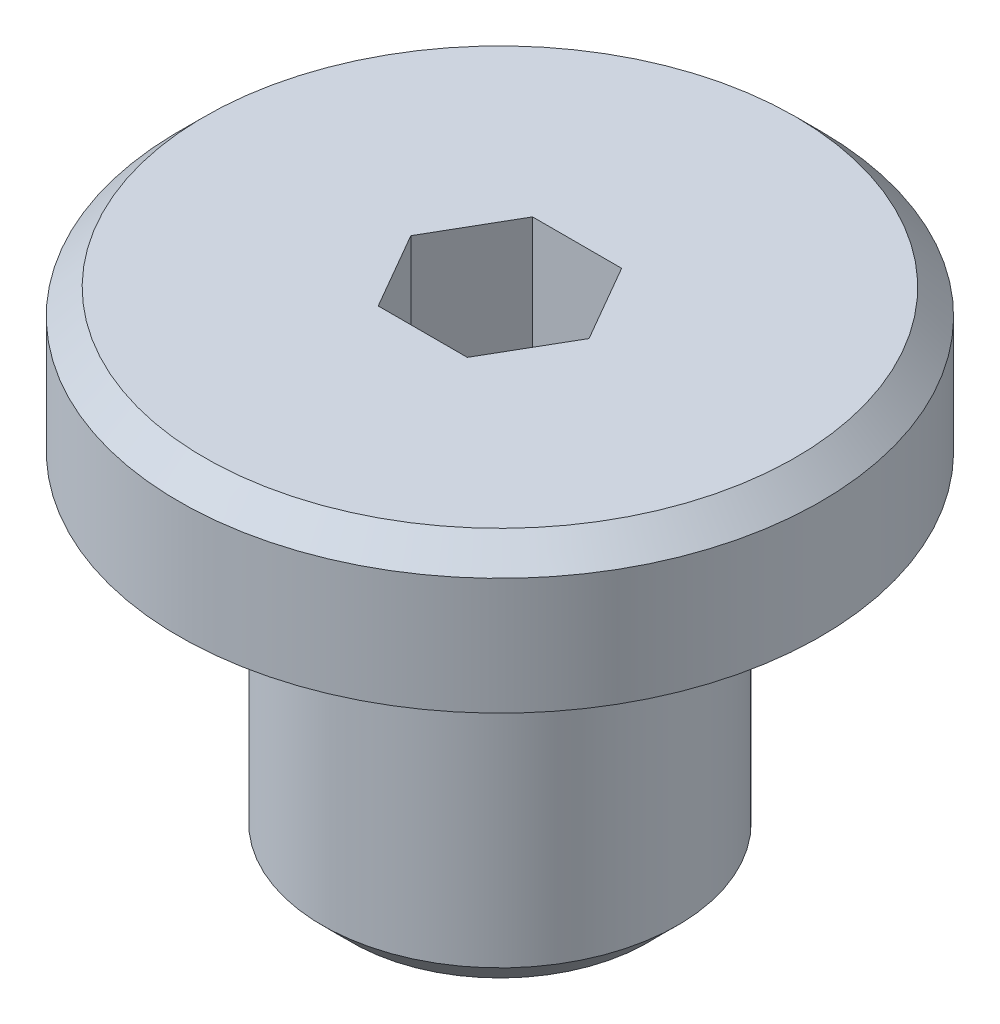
ISO-10303-21;
HEADER;
FILE_DESCRIPTION(('STEP AP214'),'2;1');
FILE_NAME('part.step','',(''),(''),'','','');
FILE_SCHEMA(('AUTOMOTIVE_DESIGN { 1 0 10303 214 1 1 1 1 }'));
ENDSEC;
DATA;
#1=APPLICATION_CONTEXT('core data for automotive mechanical design processes');
#2=APPLICATION_PROTOCOL_DEFINITION('international standard','automotive_design',2000,#1);
#3=PRODUCT_CONTEXT('',#1,'mechanical');
#4=PRODUCT('Part','Part','',(#3));
#5=PRODUCT_RELATED_PRODUCT_CATEGORY('part','',(#4));
#6=PRODUCT_DEFINITION_FORMATION('','',#4);
#7=PRODUCT_DEFINITION_CONTEXT('part definition',#1,'design');
#8=PRODUCT_DEFINITION('design','',#6,#7);
#9=PRODUCT_DEFINITION_SHAPE('','',#8);
#10=(LENGTH_UNIT() NAMED_UNIT(*) SI_UNIT(.MILLI.,.METRE.));
#11=(NAMED_UNIT(*) PLANE_ANGLE_UNIT() SI_UNIT($,.RADIAN.));
#12=(NAMED_UNIT(*) SI_UNIT($,.STERADIAN.) SOLID_ANGLE_UNIT());
#13=UNCERTAINTY_MEASURE_WITH_UNIT(LENGTH_MEASURE(1.E-05),#10,'distance_accuracy_value','');
#14=(GEOMETRIC_REPRESENTATION_CONTEXT(3) GLOBAL_UNCERTAINTY_ASSIGNED_CONTEXT((#13)) GLOBAL_UNIT_ASSIGNED_CONTEXT((#10,
#11,#12)) REPRESENTATION_CONTEXT('',''));
#15=CARTESIAN_POINT('',(0.,0.,0.));
#16=DIRECTION('',(0.,0.,1.));
#17=DIRECTION('',(1.,0.,0.));
#18=AXIS2_PLACEMENT_3D('',#15,#16,#17);
#19=CARTESIAN_POINT('',(0.,0.,-5.13080000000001));
#20=DIRECTION('',(0.,-1.,0.));
#21=DIRECTION('',(0.,0.,-1.));
#22=AXIS2_PLACEMENT_3D('',#19,#20,#21);
#23=PLANE('',#22);
#24=CARTESIAN_POINT('',(0.,0.,0.));
#25=DIRECTION('',(0.,1.,0.));
#26=DIRECTION('',(0.,0.,1.));
#27=AXIS2_PLACEMENT_3D('',#24,#25,#26);
#28=CIRCLE('',#27,6.90243030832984);
#29=CARTESIAN_POINT('',(0.,0.,6.90243030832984));
#30=VERTEX_POINT('',#29);
#31=EDGE_CURVE('E227',#30,#30,#28,.T.);
#32=ORIENTED_EDGE('',*,*,#31,.F.);
#33=EDGE_LOOP('',(#32));
#34=FACE_BOUND('',#33,.T.);
#35=CARTESIAN_POINT('',(0.,0.,0.));
#36=DIRECTION('',(0.,-1.,0.));
#37=DIRECTION('',(0.,0.,-1.));
#38=AXIS2_PLACEMENT_3D('',#35,#36,#37);
#39=CIRCLE('',#38,5.1308);
#40=CARTESIAN_POINT('',(0.,0.,-5.1308));
#41=VERTEX_POINT('',#40);
#42=EDGE_CURVE('E11',#41,#41,#39,.T.);
#43=ORIENTED_EDGE('',*,*,#42,.F.);
#44=EDGE_LOOP('',(#43));
#45=FACE_BOUND('',#44,.T.);
#46=ADVANCED_FACE('F44',(#34,#45),#23,.T.);
#47=CARTESIAN_POINT('',(0.,-0.507999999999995,0.));
#48=DIRECTION('',(0.,-1.,0.));
#49=DIRECTION('',(0.,0.,-1.));
#50=AXIS2_PLACEMENT_3D('',#47,#48,#49);
#51=TOROIDAL_SURFACE('',#50,5.1308,0.508);
#52=ORIENTED_EDGE('',*,*,#42,.T.);
#53=EDGE_LOOP('',(#52));
#54=FACE_BOUND('',#53,.T.);
#55=CARTESIAN_POINT('',(0.,-0.507999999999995,0.));
#56=DIRECTION('',(0.,-1.,0.));
#57=DIRECTION('',(0.,0.,-1.));
#58=AXIS2_PLACEMENT_3D('',#55,#56,#57);
#59=CIRCLE('',#58,4.6228);
#60=CARTESIAN_POINT('',(0.,-0.507999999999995,-4.6228));
#61=VERTEX_POINT('',#60);
#62=EDGE_CURVE('E164',#61,#61,#59,.T.);
#63=ORIENTED_EDGE('',*,*,#62,.F.);
#64=EDGE_LOOP('',(#63));
#65=FACE_BOUND('',#64,.T.);
#66=ADVANCED_FACE('F46',(#54,#65),#51,.F.);
#67=CARTESIAN_POINT('',(0.,-10.9982,0.));
#68=DIRECTION('',(0.,-1.,0.));
#69=DIRECTION('',(0.,0.,-1.));
#70=AXIS2_PLACEMENT_3D('',#67,#68,#69);
#71=PLANE('',#70);
#72=CARTESIAN_POINT('',(0.,-10.9982,0.));
#73=DIRECTION('',(0.,-1.,0.));
#74=DIRECTION('',(0.,0.,-1.));
#75=AXIS2_PLACEMENT_3D('',#72,#73,#74);
#76=CIRCLE('',#75,4.6228);
#77=CARTESIAN_POINT('',(0.,-10.9982,-4.6228));
#78=VERTEX_POINT('',#77);
#79=EDGE_CURVE('E187',#78,#78,#76,.T.);
#80=ORIENTED_EDGE('',*,*,#79,.T.);
#81=EDGE_LOOP('',(#80));
#82=FACE_BOUND('',#81,.T.);
#83=ADVANCED_FACE('F222',(#82),#71,.T.);
#84=CARTESIAN_POINT('',(0.,-10.9982,0.));
#85=DIRECTION('',(0.,1.,0.));
#86=DIRECTION('',(0.,0.,1.));
#87=AXIS2_PLACEMENT_3D('',#84,#85,#86);
#88=CONICAL_SURFACE('',#87,4.6228,0.785398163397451);
#89=CARTESIAN_POINT('',(0.,-10.06475,0.));
#90=DIRECTION('',(0.,-1.,0.));
#91=DIRECTION('',(0.,0.,-1.));
#92=AXIS2_PLACEMENT_3D('',#89,#90,#91);
#93=CIRCLE('',#92,5.55625);
#94=CARTESIAN_POINT('',(0.,-10.06475,-5.55625));
#95=VERTEX_POINT('',#94);
#96=EDGE_CURVE('E184',#95,#95,#93,.T.);
#97=ORIENTED_EDGE('',*,*,#96,.T.);
#98=EDGE_LOOP('',(#97));
#99=FACE_BOUND('',#98,.T.);
#100=ORIENTED_EDGE('',*,*,#79,.F.);
#101=EDGE_LOOP('',(#100));
#102=FACE_BOUND('',#101,.T.);
#103=ADVANCED_FACE('F248',(#99,#102),#88,.T.);
#104=CARTESIAN_POINT('',(0.,0.,0.));
#105=DIRECTION('',(0.,-1.,0.));
#106=DIRECTION('',(0.,0.,-1.));
#107=AXIS2_PLACEMENT_3D('',#104,#105,#106);
#108=CYLINDRICAL_SURFACE('',#107,5.55625);
#109=CARTESIAN_POINT('',(0.,-2.83844999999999,0.));
#110=DIRECTION('',(0.,-1.,0.));
#111=DIRECTION('',(0.,0.,-1.));
#112=AXIS2_PLACEMENT_3D('',#109,#110,#111);
#113=CIRCLE('',#112,5.55625);
#114=CARTESIAN_POINT('',(0.,-2.83844999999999,-5.55625));
#115=VERTEX_POINT('',#114);
#116=EDGE_CURVE('E180',#115,#115,#113,.T.);
#117=ORIENTED_EDGE('',*,*,#116,.T.);
#118=EDGE_LOOP('',(#117));
#119=FACE_BOUND('',#118,.T.);
#120=ORIENTED_EDGE('',*,*,#96,.F.);
#121=EDGE_LOOP('',(#120));
#122=FACE_BOUND('',#121,.T.);
#123=ADVANCED_FACE('F242',(#119,#122),#108,.T.);
#124=CARTESIAN_POINT('',(0.,-2.83844999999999,0.));
#125=DIRECTION('',(0.,-1.,0.));
#126=DIRECTION('',(0.,0.,-1.));
#127=AXIS2_PLACEMENT_3D('',#124,#125,#126);
#128=CONICAL_SURFACE('',#127,5.55625,0.78539816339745);
#129=CARTESIAN_POINT('',(0.,-1.905,0.));
#130=DIRECTION('',(0.,-1.,0.));
#131=DIRECTION('',(0.,0.,-1.));
#132=AXIS2_PLACEMENT_3D('',#129,#130,#131);
#133=CIRCLE('',#132,4.6228);
#134=CARTESIAN_POINT('',(0.,-1.905,-4.6228));
#135=VERTEX_POINT('',#134);
#136=EDGE_CURVE('E176',#135,#135,#133,.T.);
#137=ORIENTED_EDGE('',*,*,#136,.T.);
#138=EDGE_LOOP('',(#137));
#139=FACE_BOUND('',#138,.T.);
#140=ORIENTED_EDGE('',*,*,#116,.F.);
#141=EDGE_LOOP('',(#140));
#142=FACE_BOUND('',#141,.T.);
#143=ADVANCED_FACE('F236',(#139,#142),#128,.T.);
#144=CARTESIAN_POINT('',(0.,0.,0.));
#145=DIRECTION('',(0.,-1.,0.));
#146=DIRECTION('',(0.,0.,-1.));
#147=AXIS2_PLACEMENT_3D('',#144,#145,#146);
#148=CYLINDRICAL_SURFACE('',#147,4.6228);
#149=ORIENTED_EDGE('',*,*,#62,.T.);
#150=EDGE_LOOP('',(#149));
#151=FACE_BOUND('',#150,.T.);
#152=ORIENTED_EDGE('',*,*,#136,.F.);
#153=EDGE_LOOP('',(#152));
#154=FACE_BOUND('',#153,.T.);
#155=ADVANCED_FACE('F232',(#151,#154),#148,.T.);
#156=CARTESIAN_POINT('',(0.,1.06680000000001,0.));
#157=DIRECTION('',(0.,1.,0.));
#158=DIRECTION('',(0.,0.,1.));
#159=AXIS2_PLACEMENT_3D('',#156,#157,#158);
#160=TOROIDAL_SURFACE('',#159,7.2507334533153,0.254);
#161=CARTESIAN_POINT('',(0.,1.3208,0.));
#162=DIRECTION('',(0.,1.,0.));
#163=DIRECTION('',(0.,0.,1.));
#164=AXIS2_PLACEMENT_3D('',#161,#162,#163);
#165=CIRCLE('',#164,7.2507334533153);
#166=CARTESIAN_POINT('',(0.,1.3208,7.2507334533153));
#167=VERTEX_POINT('',#166);
#168=EDGE_CURVE('E298',#167,#167,#165,.T.);
#169=ORIENTED_EDGE('',*,*,#168,.F.);
#170=EDGE_LOOP('',(#169));
#171=FACE_BOUND('',#170,.T.);
#172=CARTESIAN_POINT('',(0.,1.0889375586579,0.));
#173=DIRECTION('',(0.,1.,0.));
#174=DIRECTION('',(0.,0.,1.));
#175=AXIS2_PLACEMENT_3D('',#172,#173,#174);
#176=CIRCLE('',#175,6.9977);
#177=CARTESIAN_POINT('',(0.,1.0889375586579,6.9977));
#178=VERTEX_POINT('',#177);
#179=EDGE_CURVE('E145',#178,#178,#176,.T.);
#180=ORIENTED_EDGE('',*,*,#179,.T.);
#181=EDGE_LOOP('',(#180));
#182=FACE_BOUND('',#181,.T.);
#183=ADVANCED_FACE('F235',(#171,#182),#160,.F.);
#184=CARTESIAN_POINT('',(0.,0.,0.));
#185=DIRECTION('',(0.,1.,0.));
#186=DIRECTION('',(0.,0.,1.));
#187=AXIS2_PLACEMENT_3D('',#184,#185,#186);
#188=CONICAL_SURFACE('',#187,6.90243030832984,0.0872664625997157);
#189=ORIENTED_EDGE('',*,*,#179,.F.);
#190=EDGE_LOOP('',(#189));
#191=FACE_BOUND('',#190,.T.);
#192=ORIENTED_EDGE('',*,*,#31,.T.);
#193=EDGE_LOOP('',(#192));
#194=FACE_BOUND('',#193,.T.);
#195=ADVANCED_FACE('F307',(#191,#194),#188,.T.);
#196=CARTESIAN_POINT('',(0.,1.0889375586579,0.));
#197=DIRECTION('',(0.,-1.,0.));
#198=DIRECTION('',(0.,0.,-1.));
#199=AXIS2_PLACEMENT_3D('',#196,#197,#198);
#200=CONICAL_SURFACE('',#199,9.6393,0.0872664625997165);
#201=CARTESIAN_POINT('',(0.,0.,0.));
#202=DIRECTION('',(0.,1.,0.));
#203=DIRECTION('',(0.,0.,1.));
#204=AXIS2_PLACEMENT_3D('',#201,#202,#203);
#205=CIRCLE('',#204,9.73456969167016);
#206=CARTESIAN_POINT('',(0.,0.,9.73456969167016));
#207=VERTEX_POINT('',#206);
#208=EDGE_CURVE('E287',#207,#207,#205,.T.);
#209=ORIENTED_EDGE('',*,*,#208,.F.);
#210=EDGE_LOOP('',(#209));
#211=FACE_BOUND('',#210,.T.);
#212=CARTESIAN_POINT('',(0.,1.0889375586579,0.));
#213=DIRECTION('',(0.,1.,0.));
#214=DIRECTION('',(0.,0.,1.));
#215=AXIS2_PLACEMENT_3D('',#212,#213,#214);
#216=CIRCLE('',#215,9.6393);
#217=CARTESIAN_POINT('',(0.,1.0889375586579,9.6393));
#218=VERTEX_POINT('',#217);
#219=EDGE_CURVE('E290',#218,#218,#216,.T.);
#220=ORIENTED_EDGE('',*,*,#219,.T.);
#221=EDGE_LOOP('',(#220));
#222=FACE_BOUND('',#221,.T.);
#223=ADVANCED_FACE('F313',(#211,#222),#200,.F.);
#224=CARTESIAN_POINT('',(0.,1.06680000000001,0.));
#225=DIRECTION('',(0.,1.,0.));
#226=DIRECTION('',(0.,0.,1.));
#227=AXIS2_PLACEMENT_3D('',#224,#225,#226);
#228=TOROIDAL_SURFACE('',#227,9.3862665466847,0.254);
#229=ORIENTED_EDGE('',*,*,#219,.F.);
#230=EDGE_LOOP('',(#229));
#231=FACE_BOUND('',#230,.T.);
#232=CARTESIAN_POINT('',(0.,1.3208,0.));
#233=DIRECTION('',(0.,1.,0.));
#234=DIRECTION('',(0.,0.,1.));
#235=AXIS2_PLACEMENT_3D('',#232,#233,#234);
#236=CIRCLE('',#235,9.3862665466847);
#237=CARTESIAN_POINT('',(0.,1.3208,9.3862665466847));
#238=VERTEX_POINT('',#237);
#239=EDGE_CURVE('E294',#238,#238,#236,.T.);
#240=ORIENTED_EDGE('',*,*,#239,.T.);
#241=EDGE_LOOP('',(#240));
#242=FACE_BOUND('',#241,.T.);
#243=ADVANCED_FACE('F318',(#231,#242),#228,.F.);
#244=CARTESIAN_POINT('',(0.,1.3208,-9.3862665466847));
#245=DIRECTION('',(0.,1.,0.));
#246=DIRECTION('',(0.,0.,1.));
#247=AXIS2_PLACEMENT_3D('',#244,#245,#246);
#248=PLANE('',#247);
#249=ORIENTED_EDGE('',*,*,#239,.F.);
#250=EDGE_LOOP('',(#249));
#251=FACE_BOUND('',#250,.T.);
#252=ORIENTED_EDGE('',*,*,#168,.T.);
#253=EDGE_LOOP('',(#252));
#254=FACE_BOUND('',#253,.T.);
#255=ADVANCED_FACE('F303',(#251,#254),#248,.F.);
#256=CARTESIAN_POINT('',(-1.39314619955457,0.,-2.413));
#257=DIRECTION('',(0.,1.,0.));
#258=DIRECTION('',(0.,0.,1.));
#259=AXIS2_PLACEMENT_3D('',#256,#257,#258);
#260=PLANE('',#259);
#261=DIRECTION('',(-1.,0.,0.));
#262=VECTOR('',#261,1.);
#263=CARTESIAN_POINT('',(1.39314619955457,0.,-2.413));
#264=LINE('',#263,#262);
#265=CARTESIAN_POINT('',(1.39314619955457,0.,-2.413));
#266=VERTEX_POINT('',#265);
#267=CARTESIAN_POINT('',(-1.39314619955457,0.,-2.413));
#268=VERTEX_POINT('',#267);
#269=EDGE_CURVE('E161',#266,#268,#264,.T.);
#270=ORIENTED_EDGE('',*,*,#269,.T.);
#271=DIRECTION('',(-0.5,0.,0.866025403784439));
#272=VECTOR('',#271,1.);
#273=CARTESIAN_POINT('',(-1.39314619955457,0.,-2.413));
#274=LINE('',#273,#272);
#275=CARTESIAN_POINT('',(-2.78629239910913,0.,0.));
#276=VERTEX_POINT('',#275);
#277=EDGE_CURVE('E137',#268,#276,#274,.T.);
#278=ORIENTED_EDGE('',*,*,#277,.T.);
#279=DIRECTION('',(0.5,0.,0.866025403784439));
#280=VECTOR('',#279,1.);
#281=CARTESIAN_POINT('',(-2.78629239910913,0.,0.));
#282=LINE('',#281,#280);
#283=CARTESIAN_POINT('',(-1.39314619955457,0.,2.413));
#284=VERTEX_POINT('',#283);
#285=EDGE_CURVE('E134',#276,#284,#282,.T.);
#286=ORIENTED_EDGE('',*,*,#285,.T.);
#287=DIRECTION('',(1.,0.,0.));
#288=VECTOR('',#287,1.);
#289=CARTESIAN_POINT('',(-1.39314619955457,0.,2.413));
#290=LINE('',#289,#288);
#291=CARTESIAN_POINT('',(1.39314619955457,0.,2.413));
#292=VERTEX_POINT('',#291);
#293=EDGE_CURVE('E112',#284,#292,#290,.T.);
#294=ORIENTED_EDGE('',*,*,#293,.T.);
#295=DIRECTION('',(0.5,0.,-0.866025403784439));
#296=VECTOR('',#295,1.);
#297=CARTESIAN_POINT('',(1.39314619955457,0.,2.413));
#298=LINE('',#297,#296);
#299=CARTESIAN_POINT('',(2.78629239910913,0.,0.));
#300=VERTEX_POINT('',#299);
#301=EDGE_CURVE('E124',#292,#300,#298,.T.);
#302=ORIENTED_EDGE('',*,*,#301,.T.);
#303=DIRECTION('',(-0.5,0.,-0.866025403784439));
#304=VECTOR('',#303,1.);
#305=CARTESIAN_POINT('',(2.78629239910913,0.,0.));
#306=LINE('',#305,#304);
#307=EDGE_CURVE('E128',#300,#266,#306,.T.);
#308=ORIENTED_EDGE('',*,*,#307,.T.);
#309=EDGE_LOOP('',(#270,#278,#286,#294,#302,#308));
#310=FACE_BOUND('',#309,.T.);
#311=ADVANCED_FACE('F131',(#310),#260,.T.);
#312=CARTESIAN_POINT('',(-1.39314619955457,0.,-2.413));
#313=DIRECTION('',(-0.866025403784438,0.,-0.5));
#314=DIRECTION('',(-0.5,0.,0.866025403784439));
#315=AXIS2_PLACEMENT_3D('',#312,#313,#314);
#316=PLANE('',#315);
#317=DIRECTION('',(-0.5,0.,0.866025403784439));
#318=VECTOR('',#317,1.);
#319=CARTESIAN_POINT('',(-1.39314619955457,4.445,-2.413));
#320=LINE('',#319,#318);
#321=CARTESIAN_POINT('',(-1.39314619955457,4.445,-2.413));
#322=VERTEX_POINT('',#321);
#323=CARTESIAN_POINT('',(-2.78629239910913,4.445,0.));
#324=VERTEX_POINT('',#323);
#325=EDGE_CURVE('E144',#322,#324,#320,.T.);
#326=ORIENTED_EDGE('',*,*,#325,.T.);
#327=DIRECTION('',(0.,1.,0.));
#328=VECTOR('',#327,1.);
#329=CARTESIAN_POINT('',(-2.78629239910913,0.,0.));
#330=LINE('',#329,#328);
#331=EDGE_CURVE('E169',#276,#324,#330,.T.);
#332=ORIENTED_EDGE('',*,*,#331,.F.);
#333=ORIENTED_EDGE('',*,*,#277,.F.);
#334=DIRECTION('',(0.,1.,0.));
#335=VECTOR('',#334,1.);
#336=CARTESIAN_POINT('',(-1.39314619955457,0.,-2.413));
#337=LINE('',#336,#335);
#338=EDGE_CURVE('E96',#268,#322,#337,.T.);
#339=ORIENTED_EDGE('',*,*,#338,.T.);
#340=EDGE_LOOP('',(#326,#332,#333,#339));
#341=FACE_BOUND('',#340,.T.);
#342=ADVANCED_FACE('F278',(#341),#316,.F.);
#343=CARTESIAN_POINT('',(-2.78629239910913,0.,0.));
#344=DIRECTION('',(-0.866025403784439,0.,0.5));
#345=DIRECTION('',(0.5,0.,0.866025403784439));
#346=AXIS2_PLACEMENT_3D('',#343,#344,#345);
#347=PLANE('',#346);
#348=DIRECTION('',(0.5,0.,0.866025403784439));
#349=VECTOR('',#348,1.);
#350=CARTESIAN_POINT('',(-2.78629239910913,4.445,0.));
#351=LINE('',#350,#349);
#352=CARTESIAN_POINT('',(-1.39314619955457,4.445,2.413));
#353=VERTEX_POINT('',#352);
#354=EDGE_CURVE('E149',#324,#353,#351,.T.);
#355=ORIENTED_EDGE('',*,*,#354,.T.);
#356=DIRECTION('',(0.,1.,0.));
#357=VECTOR('',#356,1.);
#358=CARTESIAN_POINT('',(-1.39314619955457,0.,2.413));
#359=LINE('',#358,#357);
#360=EDGE_CURVE('E121',#284,#353,#359,.T.);
#361=ORIENTED_EDGE('',*,*,#360,.F.);
#362=ORIENTED_EDGE('',*,*,#285,.F.);
#363=ORIENTED_EDGE('',*,*,#331,.T.);
#364=EDGE_LOOP('',(#355,#361,#362,#363));
#365=FACE_BOUND('',#364,.T.);
#366=ADVANCED_FACE('F331',(#365),#347,.F.);
#367=CARTESIAN_POINT('',(-1.39314619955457,0.,2.413));
#368=DIRECTION('',(0.,0.,1.));
#369=DIRECTION('',(1.,0.,0.));
#370=AXIS2_PLACEMENT_3D('',#367,#368,#369);
#371=PLANE('',#370);
#372=DIRECTION('',(1.,0.,0.));
#373=VECTOR('',#372,1.);
#374=CARTESIAN_POINT('',(-1.39314619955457,4.445,2.413));
#375=LINE('',#374,#373);
#376=CARTESIAN_POINT('',(1.39314619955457,4.445,2.413));
#377=VERTEX_POINT('',#376);
#378=EDGE_CURVE('E115',#353,#377,#375,.T.);
#379=ORIENTED_EDGE('',*,*,#378,.T.);
#380=DIRECTION('',(0.,1.,0.));
#381=VECTOR('',#380,1.);
#382=CARTESIAN_POINT('',(1.39314619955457,0.,2.413));
#383=LINE('',#382,#381);
#384=EDGE_CURVE('E108',#292,#377,#383,.T.);
#385=ORIENTED_EDGE('',*,*,#384,.F.);
#386=ORIENTED_EDGE('',*,*,#293,.F.);
#387=ORIENTED_EDGE('',*,*,#360,.T.);
#388=EDGE_LOOP('',(#379,#385,#386,#387));
#389=FACE_BOUND('',#388,.T.);
#390=ADVANCED_FACE('F110',(#389),#371,.F.);
#391=CARTESIAN_POINT('',(1.39314619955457,0.,2.413));
#392=DIRECTION('',(0.866025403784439,0.,0.5));
#393=DIRECTION('',(0.5,0.,-0.866025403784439));
#394=AXIS2_PLACEMENT_3D('',#391,#392,#393);
#395=PLANE('',#394);
#396=DIRECTION('',(0.5,0.,-0.866025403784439));
#397=VECTOR('',#396,1.);
#398=CARTESIAN_POINT('',(1.39314619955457,4.445,2.413));
#399=LINE('',#398,#397);
#400=CARTESIAN_POINT('',(2.78629239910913,4.445,0.));
#401=VERTEX_POINT('',#400);
#402=EDGE_CURVE('E155',#377,#401,#399,.T.);
#403=ORIENTED_EDGE('',*,*,#402,.T.);
#404=DIRECTION('',(0.,1.,0.));
#405=VECTOR('',#404,1.);
#406=CARTESIAN_POINT('',(2.78629239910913,0.,0.));
#407=LINE('',#406,#405);
#408=EDGE_CURVE('E120',#300,#401,#407,.T.);
#409=ORIENTED_EDGE('',*,*,#408,.F.);
#410=ORIENTED_EDGE('',*,*,#301,.F.);
#411=ORIENTED_EDGE('',*,*,#384,.T.);
#412=EDGE_LOOP('',(#403,#409,#410,#411));
#413=FACE_BOUND('',#412,.T.);
#414=ADVANCED_FACE('F125',(#413),#395,.F.);
#415=CARTESIAN_POINT('',(2.78629239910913,0.,0.));
#416=DIRECTION('',(0.866025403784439,0.,-0.5));
#417=DIRECTION('',(-0.5,0.,-0.866025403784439));
#418=AXIS2_PLACEMENT_3D('',#415,#416,#417);
#419=PLANE('',#418);
#420=DIRECTION('',(-0.5,0.,-0.866025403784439));
#421=VECTOR('',#420,1.);
#422=CARTESIAN_POINT('',(2.78629239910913,4.445,0.));
#423=LINE('',#422,#421);
#424=CARTESIAN_POINT('',(1.39314619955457,4.445,-2.413));
#425=VERTEX_POINT('',#424);
#426=EDGE_CURVE('E158',#401,#425,#423,.T.);
#427=ORIENTED_EDGE('',*,*,#426,.T.);
#428=DIRECTION('',(0.,1.,0.));
#429=VECTOR('',#428,1.);
#430=CARTESIAN_POINT('',(1.39314619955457,0.,-2.413));
#431=LINE('',#430,#429);
#432=EDGE_CURVE('E71',#266,#425,#431,.T.);
#433=ORIENTED_EDGE('',*,*,#432,.F.);
#434=ORIENTED_EDGE('',*,*,#307,.F.);
#435=ORIENTED_EDGE('',*,*,#408,.T.);
#436=EDGE_LOOP('',(#427,#433,#434,#435));
#437=FACE_BOUND('',#436,.T.);
#438=ADVANCED_FACE('F268',(#437),#419,.F.);
#439=CARTESIAN_POINT('',(1.39314619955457,0.,-2.413));
#440=DIRECTION('',(0.,0.,-1.));
#441=DIRECTION('',(-1.,0.,0.));
#442=AXIS2_PLACEMENT_3D('',#439,#440,#441);
#443=PLANE('',#442);
#444=DIRECTION('',(-1.,0.,0.));
#445=VECTOR('',#444,1.);
#446=CARTESIAN_POINT('',(1.39314619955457,4.445,-2.413));
#447=LINE('',#446,#445);
#448=EDGE_CURVE('E63',#425,#322,#447,.T.);
#449=ORIENTED_EDGE('',*,*,#448,.T.);
#450=ORIENTED_EDGE('',*,*,#338,.F.);
#451=ORIENTED_EDGE('',*,*,#269,.F.);
#452=ORIENTED_EDGE('',*,*,#432,.T.);
#453=EDGE_LOOP('',(#449,#450,#451,#452));
#454=FACE_BOUND('',#453,.T.);
#455=ADVANCED_FACE('F263',(#454),#443,.F.);
#456=CARTESIAN_POINT('',(0.,4.445,-9.23924999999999));
#457=DIRECTION('',(0.,1.,0.));
#458=DIRECTION('',(0.,0.,1.));
#459=AXIS2_PLACEMENT_3D('',#456,#457,#458);
#460=PLANE('',#459);
#461=ORIENTED_EDGE('',*,*,#448,.F.);
#462=ORIENTED_EDGE('',*,*,#426,.F.);
#463=ORIENTED_EDGE('',*,*,#402,.F.);
#464=ORIENTED_EDGE('',*,*,#378,.F.);
#465=ORIENTED_EDGE('',*,*,#354,.F.);
#466=ORIENTED_EDGE('',*,*,#325,.F.);
#467=EDGE_LOOP('',(#461,#462,#463,#464,#465,#466));
#468=FACE_BOUND('',#467,.T.);
#469=CARTESIAN_POINT('',(0.,4.445,0.));
#470=DIRECTION('',(0.,-1.,0.));
#471=DIRECTION('',(0.,0.,-1.));
#472=AXIS2_PLACEMENT_3D('',#469,#470,#471);
#473=CIRCLE('',#472,9.23924999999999);
#474=CARTESIAN_POINT('',(0.,4.445,-9.23924999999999));
#475=VERTEX_POINT('',#474);
#476=EDGE_CURVE('E190',#475,#475,#473,.T.);
#477=ORIENTED_EDGE('',*,*,#476,.F.);
#478=EDGE_LOOP('',(#477));
#479=FACE_BOUND('',#478,.T.);
#480=ADVANCED_FACE('F214',(#468,#479),#460,.T.);
#481=CARTESIAN_POINT('',(0.,3.65124999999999,0.));
#482=DIRECTION('',(0.,-1.,0.));
#483=DIRECTION('',(0.,0.,-1.));
#484=AXIS2_PLACEMENT_3D('',#481,#482,#483);
#485=CONICAL_SURFACE('',#484,10.033,0.785398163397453);
#486=ORIENTED_EDGE('',*,*,#476,.T.);
#487=EDGE_LOOP('',(#486));
#488=FACE_BOUND('',#487,.T.);
#489=CARTESIAN_POINT('',(0.,3.65124999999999,0.));
#490=DIRECTION('',(0.,-1.,0.));
#491=DIRECTION('',(0.,0.,-1.));
#492=AXIS2_PLACEMENT_3D('',#489,#490,#491);
#493=CIRCLE('',#492,10.033);
#494=CARTESIAN_POINT('',(0.,3.65124999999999,-10.033));
#495=VERTEX_POINT('',#494);
#496=EDGE_CURVE('E194',#495,#495,#493,.T.);
#497=ORIENTED_EDGE('',*,*,#496,.F.);
#498=EDGE_LOOP('',(#497));
#499=FACE_BOUND('',#498,.T.);
#500=ADVANCED_FACE('F206',(#488,#499),#485,.T.);
#501=CARTESIAN_POINT('',(0.,0.,0.));
#502=DIRECTION('',(0.,-1.,0.));
#503=DIRECTION('',(0.,0.,-1.));
#504=AXIS2_PLACEMENT_3D('',#501,#502,#503);
#505=CYLINDRICAL_SURFACE('',#504,10.033);
#506=ORIENTED_EDGE('',*,*,#496,.T.);
#507=EDGE_LOOP('',(#506));
#508=FACE_BOUND('',#507,.T.);
#509=CARTESIAN_POINT('',(0.,0.,0.));
#510=DIRECTION('',(0.,-1.,0.));
#511=DIRECTION('',(0.,0.,-1.));
#512=AXIS2_PLACEMENT_3D('',#509,#510,#511);
#513=CIRCLE('',#512,10.033);
#514=CARTESIAN_POINT('',(0.,0.,-10.033));
#515=VERTEX_POINT('',#514);
#516=EDGE_CURVE('E53',#515,#515,#513,.T.);
#517=ORIENTED_EDGE('',*,*,#516,.F.);
#518=EDGE_LOOP('',(#517));
#519=FACE_BOUND('',#518,.T.);
#520=ADVANCED_FACE('F204',(#508,#519),#505,.T.);
#521=ORIENTED_EDGE('',*,*,#208,.T.);
#522=EDGE_LOOP('',(#521));
#523=FACE_BOUND('',#522,.T.);
#524=ORIENTED_EDGE('',*,*,#516,.T.);
#525=EDGE_LOOP('',(#524));
#526=FACE_BOUND('',#525,.T.);
#527=ADVANCED_FACE('F202',(#523,#526),#23,.T.);
#528=CLOSED_SHELL('',(#46,#66,#83,#103,#123,#143,#155,#183,#195,#223,#243,#255,#311,#342,#366,
#390,#414,#438,#455,#480,#500,#520,#527));
#529=MANIFOLD_SOLID_BREP('B2',#528);
#530=ADVANCED_BREP_SHAPE_REPRESENTATION('',(#18,#529),#14);
#531=SHAPE_DEFINITION_REPRESENTATION(#9,#530);
ENDSEC;
END-ISO-10303-21;
